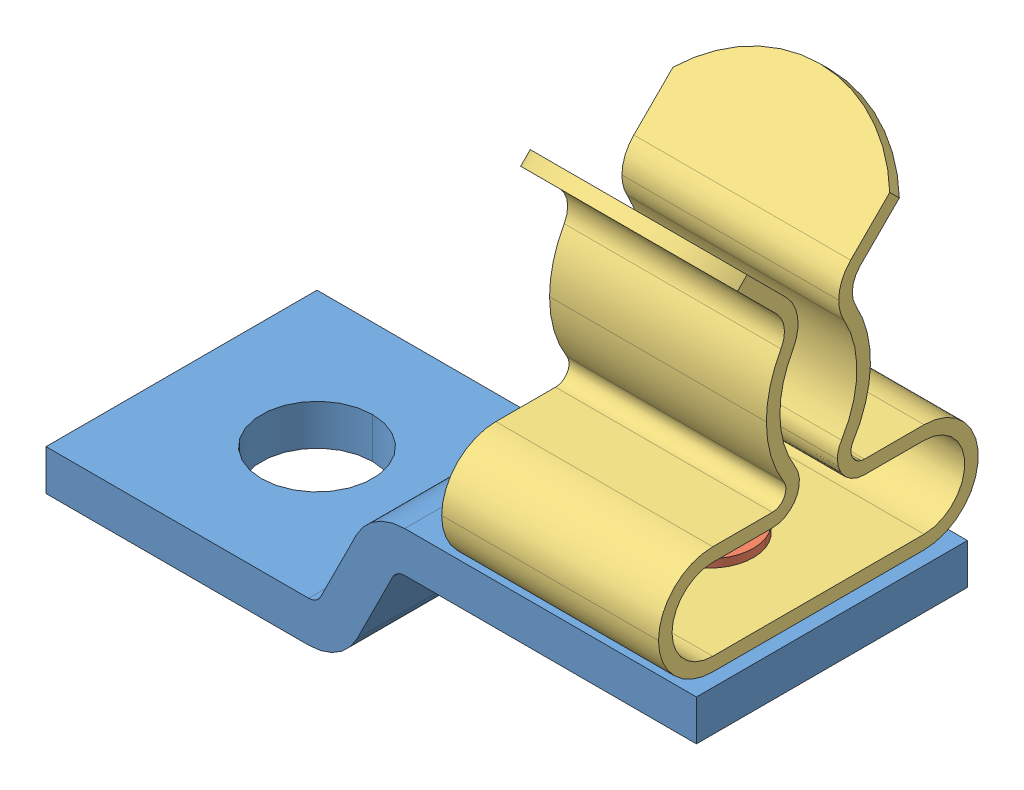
SolidWorks assembly 36253.SLDASM, configuration Default (file format 8000). Lengths in mm.
Overall size (24 18.97 11.8).
3 component instances, 3 part files, 0 mates.
Components (placement in the parent):
- 36253_01-1: 36253_01.SLDPRT [Default] at origin size (24 5.5 10)
- 36253_02-1: 36253_02.SLDPRT [Default] at origin size (6 3.3 6)
- 36253_03-1: 36253_03.SLDPRT [Default] at origin size (8 13.47 11.8)
